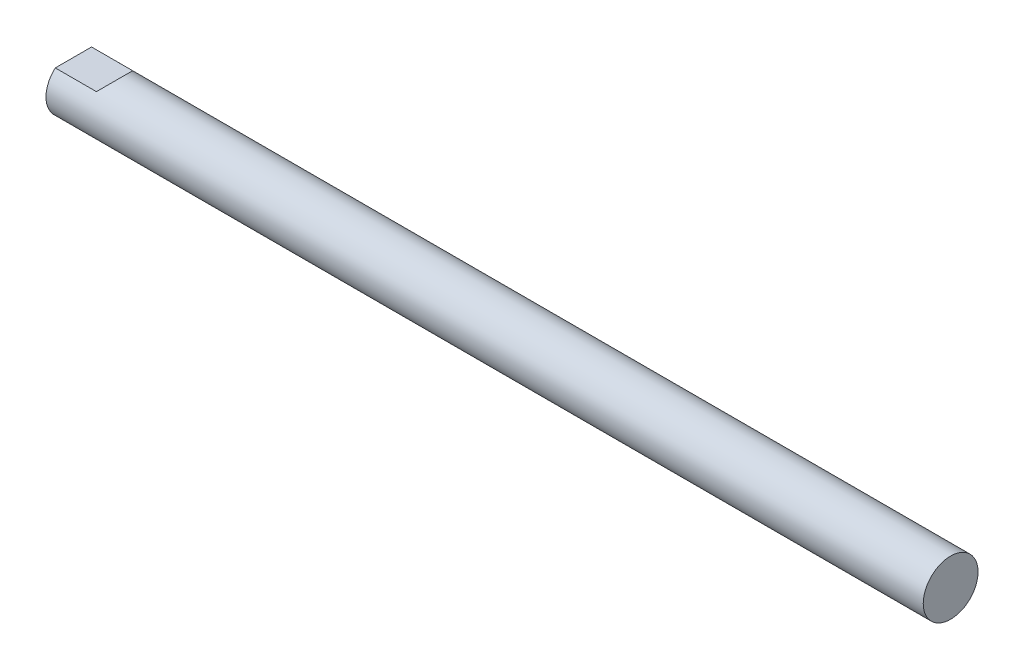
ISO-10303-21;
HEADER;
FILE_DESCRIPTION(('STEP AP214'),'2;1');
FILE_NAME('part.step','',(''),(''),'','','');
FILE_SCHEMA(('AUTOMOTIVE_DESIGN { 1 0 10303 214 1 1 1 1 }'));
ENDSEC;
DATA;
#1=APPLICATION_CONTEXT('core data for automotive mechanical design processes');
#2=APPLICATION_PROTOCOL_DEFINITION('international standard','automotive_design',2000,#1);
#3=PRODUCT_CONTEXT('',#1,'mechanical');
#4=PRODUCT('Part','Part','',(#3));
#5=PRODUCT_RELATED_PRODUCT_CATEGORY('part','',(#4));
#6=PRODUCT_DEFINITION_FORMATION('','',#4);
#7=PRODUCT_DEFINITION_CONTEXT('part definition',#1,'design');
#8=PRODUCT_DEFINITION('design','',#6,#7);
#9=PRODUCT_DEFINITION_SHAPE('','',#8);
#10=(LENGTH_UNIT() NAMED_UNIT(*) SI_UNIT(.MILLI.,.METRE.));
#11=(NAMED_UNIT(*) PLANE_ANGLE_UNIT() SI_UNIT($,.RADIAN.));
#12=(NAMED_UNIT(*) SI_UNIT($,.STERADIAN.) SOLID_ANGLE_UNIT());
#13=UNCERTAINTY_MEASURE_WITH_UNIT(LENGTH_MEASURE(1.E-05),#10,'distance_accuracy_value','');
#14=(GEOMETRIC_REPRESENTATION_CONTEXT(3) GLOBAL_UNCERTAINTY_ASSIGNED_CONTEXT((#13)) GLOBAL_UNIT_ASSIGNED_CONTEXT((#10,
#11,#12)) REPRESENTATION_CONTEXT('',''));
#15=CARTESIAN_POINT('',(0.,0.,0.));
#16=DIRECTION('',(0.,0.,1.));
#17=DIRECTION('',(1.,0.,0.));
#18=AXIS2_PLACEMENT_3D('',#15,#16,#17);
#19=CARTESIAN_POINT('',(0.,0.,0.));
#20=DIRECTION('',(1.,0.,0.));
#21=DIRECTION('',(0.,0.,-1.));
#22=AXIS2_PLACEMENT_3D('',#19,#20,#21);
#23=PLANE('',#22);
#24=CARTESIAN_POINT('',(0.,0.,0.));
#25=DIRECTION('',(-1.,0.,0.));
#26=DIRECTION('',(0.,0.,1.));
#27=AXIS2_PLACEMENT_3D('',#24,#25,#26);
#28=CIRCLE('',#27,5.35813);
#29=CARTESIAN_POINT('',(0.,0.,5.35813));
#30=VERTEX_POINT('',#29);
#31=EDGE_CURVE('E74',#30,#30,#28,.T.);
#32=ORIENTED_EDGE('',*,*,#31,.F.);
#33=EDGE_LOOP('',(#32));
#34=FACE_BOUND('',#33,.T.);
#35=CARTESIAN_POINT('',(0.,0.,0.));
#36=DIRECTION('',(-1.,0.,0.));
#37=DIRECTION('',(0.,0.,1.));
#38=AXIS2_PLACEMENT_3D('',#35,#36,#37);
#39=CIRCLE('',#38,12.7);
#40=CARTESIAN_POINT('',(0.,9.525,-8.40026041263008));
#41=VERTEX_POINT('',#40);
#42=CARTESIAN_POINT('',(0.,9.525,8.40026041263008));
#43=VERTEX_POINT('',#42);
#44=EDGE_CURVE('E86',#41,#43,#39,.T.);
#45=ORIENTED_EDGE('',*,*,#44,.T.);
#46=DIRECTION('',(0.,0.,1.));
#47=VECTOR('',#46,1.);
#48=CARTESIAN_POINT('',(0.,9.525,-12.7));
#49=LINE('',#48,#47);
#50=EDGE_CURVE('E72',#41,#43,#49,.T.);
#51=ORIENTED_EDGE('',*,*,#50,.F.);
#52=EDGE_LOOP('',(#45,#51));
#53=FACE_BOUND('',#52,.T.);
#54=ADVANCED_FACE('F36',(#34,#53),#23,.F.);
#55=CARTESIAN_POINT('',(-29.8621621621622,0.,0.));
#56=DIRECTION('',(-1.,0.,0.));
#57=DIRECTION('',(0.,0.,1.));
#58=AXIS2_PLACEMENT_3D('',#55,#56,#57);
#59=CYLINDRICAL_SURFACE('',#58,12.7);
#60=CARTESIAN_POINT('',(9.52500000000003,0.,0.));
#61=DIRECTION('',(0.707106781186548,-0.707106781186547,0.));
#62=DIRECTION('',(-0.707106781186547,-0.707106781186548,0.));
#63=AXIS2_PLACEMENT_3D('',#60,#61,#62);
#64=ELLIPSE('',#63,17.9605122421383,12.7);
#65=CARTESIAN_POINT('',(19.05,9.525,-8.40026041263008));
#66=VERTEX_POINT('',#65);
#67=CARTESIAN_POINT('',(19.05,9.525,8.40026041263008));
#68=VERTEX_POINT('',#67);
#69=EDGE_CURVE('E43',#66,#68,#64,.T.);
#70=ORIENTED_EDGE('',*,*,#69,.T.);
#71=DIRECTION('',(-1.,0.,0.));
#72=VECTOR('',#71,1.);
#73=CARTESIAN_POINT('',(-29.8621621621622,9.525,8.40026041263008));
#74=LINE('',#73,#72);
#75=EDGE_CURVE('E11',#68,#43,#74,.T.);
#76=ORIENTED_EDGE('',*,*,#75,.T.);
#77=ORIENTED_EDGE('',*,*,#44,.F.);
#78=DIRECTION('',(-1.,0.,0.));
#79=VECTOR('',#78,1.);
#80=CARTESIAN_POINT('',(-29.8621621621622,9.525,-8.40026041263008));
#81=LINE('',#80,#79);
#82=EDGE_CURVE('E68',#41,#66,#81,.F.);
#83=ORIENTED_EDGE('',*,*,#82,.T.);
#84=EDGE_LOOP('',(#70,#76,#77,#83));
#85=FACE_BOUND('',#84,.T.);
#86=CARTESIAN_POINT('',(406.4,0.,0.));
#87=DIRECTION('',(-1.,0.,0.));
#88=DIRECTION('',(0.,0.,1.));
#89=AXIS2_PLACEMENT_3D('',#86,#87,#88);
#90=CIRCLE('',#89,12.7);
#91=CARTESIAN_POINT('',(406.4,0.,12.7));
#92=VERTEX_POINT('',#91);
#93=EDGE_CURVE('E83',#92,#92,#90,.T.);
#94=ORIENTED_EDGE('',*,*,#93,.T.);
#95=EDGE_LOOP('',(#94));
#96=FACE_BOUND('',#95,.T.);
#97=ADVANCED_FACE('F64',(#85,#96),#59,.T.);
#98=CARTESIAN_POINT('',(406.4,12.7,0.));
#99=DIRECTION('',(-1.,0.,0.));
#100=DIRECTION('',(0.,0.,1.));
#101=AXIS2_PLACEMENT_3D('',#98,#99,#100);
#102=PLANE('',#101);
#103=ORIENTED_EDGE('',*,*,#93,.F.);
#104=EDGE_LOOP('',(#103));
#105=FACE_BOUND('',#104,.T.);
#106=ADVANCED_FACE('F94',(#105),#102,.F.);
#107=CARTESIAN_POINT('',(35.179,0.,0.));
#108=DIRECTION('',(-1.,0.,0.));
#109=DIRECTION('',(0.,0.,1.));
#110=AXIS2_PLACEMENT_3D('',#107,#108,#109);
#111=CONICAL_SURFACE('',#110,5.35812999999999,1.02974425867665);
#112=CARTESIAN_POINT('',(38.3984893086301,0.,0.));
#113=VERTEX_POINT('',#112);
#114=VERTEX_LOOP('',#113);
#115=FACE_BOUND('',#114,.T.);
#116=CARTESIAN_POINT('',(35.179,0.,0.));
#117=DIRECTION('',(-1.,0.,0.));
#118=DIRECTION('',(0.,0.,1.));
#119=AXIS2_PLACEMENT_3D('',#116,#117,#118);
#120=CIRCLE('',#119,5.35812999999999);
#121=CARTESIAN_POINT('',(35.179,0.,5.35812999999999));
#122=VERTEX_POINT('',#121);
#123=EDGE_CURVE('E77',#122,#122,#120,.T.);
#124=ORIENTED_EDGE('',*,*,#123,.T.);
#125=EDGE_LOOP('',(#124));
#126=FACE_BOUND('',#125,.T.);
#127=ADVANCED_FACE('F99',(#115,#126),#111,.F.);
#128=CARTESIAN_POINT('',(0.,0.,0.));
#129=DIRECTION('',(-1.,0.,0.));
#130=DIRECTION('',(0.,0.,1.));
#131=AXIS2_PLACEMENT_3D('',#128,#129,#130);
#132=CYLINDRICAL_SURFACE('',#131,5.35812999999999);
#133=ORIENTED_EDGE('',*,*,#123,.F.);
#134=EDGE_LOOP('',(#133));
#135=FACE_BOUND('',#134,.T.);
#136=ORIENTED_EDGE('',*,*,#31,.T.);
#137=EDGE_LOOP('',(#136));
#138=FACE_BOUND('',#137,.T.);
#139=ADVANCED_FACE('F97',(#135,#138),#132,.F.);
#140=CARTESIAN_POINT('',(19.05,9.525,-12.7));
#141=DIRECTION('',(0.707106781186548,-0.707106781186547,0.));
#142=DIRECTION('',(0.707106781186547,0.707106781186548,0.));
#143=AXIS2_PLACEMENT_3D('',#140,#141,#142);
#144=PLANE('',#143);
#145=DIRECTION('',(0.,0.,1.));
#146=VECTOR('',#145,1.);
#147=CARTESIAN_POINT('',(19.05,9.525,-12.7));
#148=LINE('',#147,#146);
#149=EDGE_CURVE('E50',#66,#68,#148,.T.);
#150=ORIENTED_EDGE('',*,*,#149,.T.);
#151=ORIENTED_EDGE('',*,*,#69,.F.);
#152=EDGE_LOOP('',(#150,#151));
#153=FACE_BOUND('',#152,.T.);
#154=ADVANCED_FACE('F73',(#153),#144,.F.);
#155=CARTESIAN_POINT('',(0.,9.525,-12.7));
#156=DIRECTION('',(0.,-1.,0.));
#157=DIRECTION('',(0.,0.,-1.));
#158=AXIS2_PLACEMENT_3D('',#155,#156,#157);
#159=PLANE('',#158);
#160=ORIENTED_EDGE('',*,*,#149,.F.);
#161=ORIENTED_EDGE('',*,*,#82,.F.);
#162=ORIENTED_EDGE('',*,*,#50,.T.);
#163=ORIENTED_EDGE('',*,*,#75,.F.);
#164=EDGE_LOOP('',(#160,#161,#162,#163));
#165=FACE_BOUND('',#164,.T.);
#166=ADVANCED_FACE('F70',(#165),#159,.F.);
#167=CLOSED_SHELL('',(#54,#97,#106,#127,#139,#154,#166));
#168=MANIFOLD_SOLID_BREP('B2',#167);
#169=ADVANCED_BREP_SHAPE_REPRESENTATION('',(#18,#168),#14);
#170=SHAPE_DEFINITION_REPRESENTATION(#9,#169);
ENDSEC;
END-ISO-10303-21;
